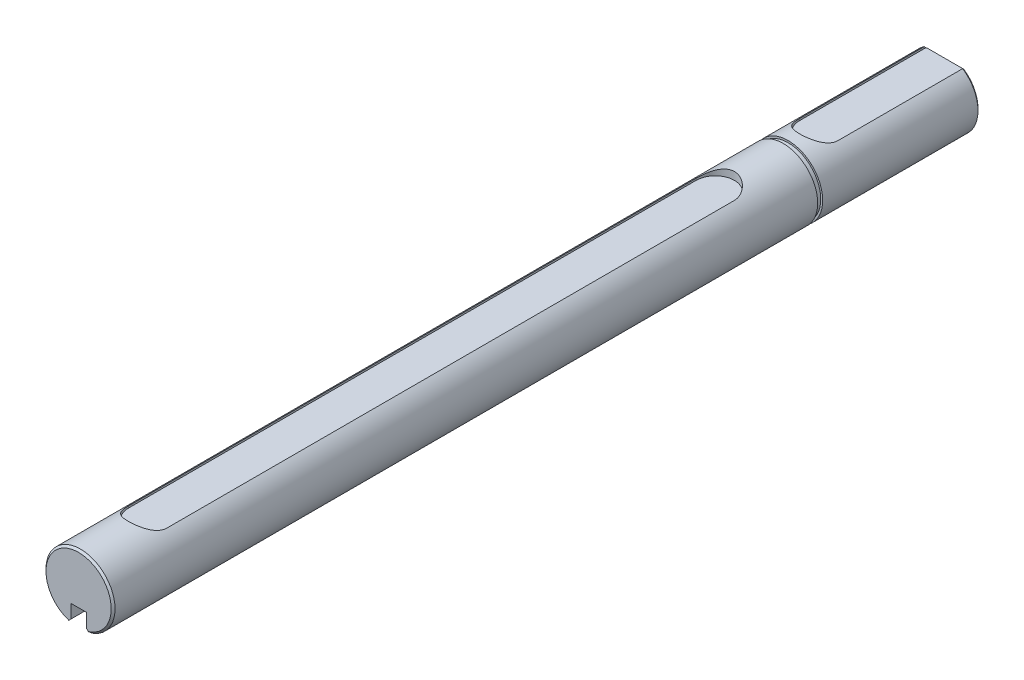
ISO-10303-21;
HEADER;
FILE_DESCRIPTION(('STEP AP214'),'2;1');
FILE_NAME('part.step','',(''),(''),'','','');
FILE_SCHEMA(('AUTOMOTIVE_DESIGN { 1 0 10303 214 1 1 1 1 }'));
ENDSEC;
DATA;
#1=APPLICATION_CONTEXT('core data for automotive mechanical design processes');
#2=APPLICATION_PROTOCOL_DEFINITION('international standard','automotive_design',2000,#1);
#3=PRODUCT_CONTEXT('',#1,'mechanical');
#4=PRODUCT('Part','Part','',(#3));
#5=PRODUCT_RELATED_PRODUCT_CATEGORY('part','',(#4));
#6=PRODUCT_DEFINITION_FORMATION('','',#4);
#7=PRODUCT_DEFINITION_CONTEXT('part definition',#1,'design');
#8=PRODUCT_DEFINITION('design','',#6,#7);
#9=PRODUCT_DEFINITION_SHAPE('','',#8);
#10=(LENGTH_UNIT() NAMED_UNIT(*) SI_UNIT(.MILLI.,.METRE.));
#11=(NAMED_UNIT(*) PLANE_ANGLE_UNIT() SI_UNIT($,.RADIAN.));
#12=(NAMED_UNIT(*) SI_UNIT($,.STERADIAN.) SOLID_ANGLE_UNIT());
#13=UNCERTAINTY_MEASURE_WITH_UNIT(LENGTH_MEASURE(1.E-05),#10,'distance_accuracy_value','');
#14=(GEOMETRIC_REPRESENTATION_CONTEXT(3) GLOBAL_UNCERTAINTY_ASSIGNED_CONTEXT((#13)) GLOBAL_UNIT_ASSIGNED_CONTEXT((#10,
#11,#12)) REPRESENTATION_CONTEXT('',''));
#15=CARTESIAN_POINT('',(0.,0.,0.));
#16=DIRECTION('',(0.,0.,1.));
#17=DIRECTION('',(1.,0.,0.));
#18=AXIS2_PLACEMENT_3D('',#15,#16,#17);
#19=CARTESIAN_POINT('',(0.,7.,-193.));
#20=DIRECTION('',(0.,1.,0.));
#21=DIRECTION('',(-1.,0.,0.));
#22=AXIS2_PLACEMENT_3D('',#19,#20,#21);
#23=CYLINDRICAL_SURFACE('',#22,5.);
#24=DIRECTION('',(0.,-1.,0.));
#25=VECTOR('',#24,1.);
#26=CARTESIAN_POINT('',(5.,8.,-193.));
#27=LINE('',#26,#25);
#28=CARTESIAN_POINT('',(5.00000000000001,7.48331477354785,-193.));
#29=VERTEX_POINT('',#28);
#30=CARTESIAN_POINT('',(5.,7.00000000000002,-193.));
#31=VERTEX_POINT('',#30);
#32=EDGE_CURVE('E143',#29,#31,#27,.T.);
#33=ORIENTED_EDGE('',*,*,#32,.T.);
#34=CARTESIAN_POINT('',(0.,7.,-193.));
#35=DIRECTION('',(0.,1.,0.));
#36=DIRECTION('',(-1.,0.,0.));
#37=AXIS2_PLACEMENT_3D('',#34,#35,#36);
#38=CIRCLE('',#37,5.);
#39=CARTESIAN_POINT('',(-5.,7.00000000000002,-193.));
#40=VERTEX_POINT('',#39);
#41=EDGE_CURVE('E168',#31,#40,#38,.F.);
#42=ORIENTED_EDGE('',*,*,#41,.T.);
#43=DIRECTION('',(0.,1.,0.));
#44=VECTOR('',#43,1.);
#45=CARTESIAN_POINT('',(-5.,8.,-193.));
#46=LINE('',#45,#44);
#47=CARTESIAN_POINT('',(-5.00000000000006,7.48331477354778,-193.));
#48=VERTEX_POINT('',#47);
#49=EDGE_CURVE('E157',#40,#48,#46,.T.);
#50=ORIENTED_EDGE('',*,*,#49,.T.);
#51=CARTESIAN_POINT('',(-5.,7.48331477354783,-193.));
#52=CARTESIAN_POINT('',(-5.00001374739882,7.48329038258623,-192.890749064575));
#53=CARTESIAN_POINT('',(-4.99641969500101,7.48570664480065,-192.781511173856));
#54=CARTESIAN_POINT('',(-4.98212333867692,7.49523721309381,-192.56375303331));
#55=CARTESIAN_POINT('',(-4.97142409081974,7.50234949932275,-192.455232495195));
#56=CARTESIAN_POINT('',(-4.94292336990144,7.52115589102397,-192.238737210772));
#57=CARTESIAN_POINT('',(-4.9250718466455,7.53288227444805,-192.130771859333));
#58=CARTESIAN_POINT('',(-4.88247272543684,7.56056231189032,-191.916775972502));
#59=CARTESIAN_POINT('',(-4.85772448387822,7.57651636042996,-191.810745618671));
#60=CARTESIAN_POINT('',(-4.77283998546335,7.63050267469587,-191.493989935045));
#61=CARTESIAN_POINT('',(-4.70237573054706,7.67444246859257,-191.286935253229));
#62=CARTESIAN_POINT('',(-4.53542945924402,7.77427771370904,-190.883839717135));
#63=CARTESIAN_POINT('',(-4.43864699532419,7.83030958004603,-190.687959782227));
#64=CARTESIAN_POINT('',(-4.22063980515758,7.94995509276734,-190.310364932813));
#65=CARTESIAN_POINT('',(-4.09920488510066,8.01363187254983,-190.128791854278));
#66=CARTESIAN_POINT('',(-3.83383147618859,8.14393398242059,-189.78294608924));
#67=CARTESIAN_POINT('',(-3.68981020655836,8.21056948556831,-189.618740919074));
#68=CARTESIAN_POINT('',(-3.38155656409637,8.34224816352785,-189.310490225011));
#69=CARTESIAN_POINT('',(-3.21736385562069,8.40729417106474,-189.166406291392));
#70=CARTESIAN_POINT('',(-2.87142978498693,8.53161351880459,-188.900965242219));
#71=CARTESIAN_POINT('',(-2.68981521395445,8.5909230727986,-188.779460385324));
#72=CARTESIAN_POINT('',(-2.31205434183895,8.70015280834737,-188.561364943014));
#73=CARTESIAN_POINT('',(-2.1160687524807,8.75015969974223,-188.464540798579));
#74=CARTESIAN_POINT('',(-1.71290388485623,8.83787526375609,-188.297549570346));
#75=CARTESIAN_POINT('',(-1.50586450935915,8.87570811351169,-188.227112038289));
#76=CARTESIAN_POINT('',(-1.0841905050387,8.93697329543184,-188.114129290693));
#77=CARTESIAN_POINT('',(-0.869638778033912,8.96052945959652,-188.071344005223));
#78=CARTESIAN_POINT('',(-0.436708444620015,8.99200401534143,-188.01435026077));
#79=CARTESIAN_POINT('',(-0.218354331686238,8.99999999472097,-188.000000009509));
#80=CARTESIAN_POINT('',(0.21835389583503,9.00000000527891,-187.999999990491));
#81=CARTESIAN_POINT('',(0.43670801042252,8.99200403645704,-188.014350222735));
#82=CARTESIAN_POINT('',(0.869638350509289,8.96052950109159,-188.071343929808));
#83=CARTESIAN_POINT('',(1.0841900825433,8.93697334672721,-188.11412919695));
#84=CARTESIAN_POINT('',(1.50586410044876,8.87570818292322,-188.227111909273));
#85=CARTESIAN_POINT('',(1.71290348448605,8.83787534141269,-188.297549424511));
#86=CARTESIAN_POINT('',(2.11606837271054,8.75015979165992,-188.464540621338));
#87=CARTESIAN_POINT('',(2.3120539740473,8.70015290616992,-188.561364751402));
#88=CARTESIAN_POINT('',(2.68981487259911,8.5909231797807,-188.779460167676));
#89=CARTESIAN_POINT('',(2.87142945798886,8.53161362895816,-188.900965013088));
#90=CARTESIAN_POINT('',(3.21736354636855,8.40729428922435,-189.166406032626));
#91=CARTESIAN_POINT('',(3.38155625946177,8.34224828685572,-189.310489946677));
#92=CARTESIAN_POINT('',(3.6898099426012,8.21056960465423,-189.618740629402));
#93=CARTESIAN_POINT('',(3.83383124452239,8.14393409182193,-189.782945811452));
#94=CARTESIAN_POINT('',(4.09920471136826,8.01363196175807,-190.128791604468));
#95=CARTESIAN_POINT('',(4.22063965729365,7.94995517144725,-190.310364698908));
#96=CARTESIAN_POINT('',(4.4386468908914,7.83030963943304,-190.687959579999));
#97=CARTESIAN_POINT('',(4.53542937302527,7.77427776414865,-190.883839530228));
#98=CARTESIAN_POINT('',(4.70237568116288,7.67444249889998,-191.286935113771));
#99=CARTESIAN_POINT('',(4.77283995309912,7.63050269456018,-191.49398982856));
#100=CARTESIAN_POINT('',(4.8577244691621,7.57651636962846,-191.810745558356));
#101=CARTESIAN_POINT('',(4.88247271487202,7.5605623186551,-191.916775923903));
#102=CARTESIAN_POINT('',(4.92507184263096,7.53288227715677,-192.130771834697));
#103=CARTESIAN_POINT('',(4.94292336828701,7.52115589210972,-192.238737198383));
#104=CARTESIAN_POINT('',(4.9714240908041,7.50234949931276,-192.455232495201));
#105=CARTESIAN_POINT('',(4.98212333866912,7.49523721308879,-192.563753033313));
#106=CARTESIAN_POINT('',(4.99641969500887,7.48570664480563,-192.781511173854));
#107=CARTESIAN_POINT('',(5.00001374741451,7.4832903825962,-192.890749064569));
#108=CARTESIAN_POINT('',(5.,7.48331477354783,-193.));
#109=B_SPLINE_CURVE_WITH_KNOTS('',3,(#51,#52,#53,#54,#55,#56,#57,#58,#59,#60,#61,#62,#63,#64,
#65,#66,#67,#68,#69,#70,#71,#72,#73,#74,#75,#76,#77,#78,#79,#80,#81,#82,#83,#84,#85,#86,#87,#88,
#89,#90,#91,#92,#93,#94,#95,#96,#97,#98,#99,#100,#101,#102,#103,#104,#105,#106,#107,#108),
.UNSPECIFIED.,.F.,.F.,(4,2,2,2,2,2,2,2,2,2,2,2,2,2,2,2,2,2,2,2,2,2,2,2,2,2,2,2,4),(0.,
0.327645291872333,0.655149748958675,0.984987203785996,1.31485544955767,1.98161894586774,
2.65633924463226,3.33707417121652,4.02036500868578,4.70233313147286,5.37966842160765,
6.05033369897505,6.7139236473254,7.37167220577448,8.02613254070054,8.68059287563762,
9.33834143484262,10.0019313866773,10.6725966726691,11.3499319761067,12.031900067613,
12.715190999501,13.3959260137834,14.0706463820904,14.7374099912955,15.0672782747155,
15.3971157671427,15.7246202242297,16.0522655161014),.UNSPECIFIED.);
#110=EDGE_CURVE('E21',#48,#29,#109,.T.);
#111=ORIENTED_EDGE('',*,*,#110,.T.);
#112=EDGE_LOOP('',(#33,#42,#50,#111));
#113=FACE_BOUND('',#112,.T.);
#114=ADVANCED_FACE('F17',(#113),#23,.F.);
#115=CARTESIAN_POINT('',(-5.,7.,-188.));
#116=DIRECTION('',(0.,-1.,0.));
#117=DIRECTION('',(0.,0.,-1.));
#118=AXIS2_PLACEMENT_3D('',#115,#116,#117);
#119=PLANE('',#118);
#120=CARTESIAN_POINT('',(4.82182538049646,7.,-226.));
#121=CARTESIAN_POINT('',(4.85161069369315,7.,-225.983101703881));
#122=CARTESIAN_POINT('',(4.88135123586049,7.,-225.96612544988));
#123=CARTESIAN_POINT('',(4.94074277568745,7.,-225.93201702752));
#124=CARTESIAN_POINT('',(4.97039377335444,7.,-225.914884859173));
#125=CARTESIAN_POINT('',(4.99999999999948,7.,-225.897674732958));
#126=B_SPLINE_CURVE_WITH_KNOTS('',3,(#120,#121,#122,#123,#124,#125),.UNSPECIFIED.,.F.,.F.,(4,2,
4),(0.,0.102733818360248,0.205467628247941),.UNSPECIFIED.);
#127=CARTESIAN_POINT('',(4.8218253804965,6.99999999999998,-226.));
#128=VERTEX_POINT('',#127);
#129=CARTESIAN_POINT('',(4.99999999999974,7.00000000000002,-225.897674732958));
#130=VERTEX_POINT('',#129);
#131=EDGE_CURVE('E428',#128,#130,#126,.T.);
#132=ORIENTED_EDGE('',*,*,#131,.F.);
#133=DIRECTION('',(1.,0.,0.));
#134=VECTOR('',#133,1.);
#135=CARTESIAN_POINT('',(-3.9537630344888,6.99999999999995,-226.));
#136=LINE('',#135,#134);
#137=CARTESIAN_POINT('',(-4.82182538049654,6.99999999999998,-226.));
#138=VERTEX_POINT('',#137);
#139=EDGE_CURVE('E342',#138,#128,#136,.T.);
#140=ORIENTED_EDGE('',*,*,#139,.F.);
#141=CARTESIAN_POINT('',(-4.82182538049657,7.,-226.));
#142=CARTESIAN_POINT('',(-4.85161069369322,7.,-225.983101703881));
#143=CARTESIAN_POINT('',(-4.88135123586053,7.,-225.96612544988));
#144=CARTESIAN_POINT('',(-4.94074277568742,7.,-225.93201702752));
#145=CARTESIAN_POINT('',(-4.97039377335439,7.,-225.914884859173));
#146=CARTESIAN_POINT('',(-4.99999999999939,7.,-225.897674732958));
#147=B_SPLINE_CURVE_WITH_KNOTS('',3,(#141,#142,#143,#144,#145,#146),.UNSPECIFIED.,.F.,.F.,(4,2,
4),(0.,0.102733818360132,0.205467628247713),.UNSPECIFIED.);
#148=CARTESIAN_POINT('',(-4.9999999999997,6.99999999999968,-225.897674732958));
#149=VERTEX_POINT('',#148);
#150=EDGE_CURVE('E338',#138,#149,#147,.T.);
#151=ORIENTED_EDGE('',*,*,#150,.T.);
#152=DIRECTION('',(0.,0.,1.));
#153=VECTOR('',#152,1.);
#154=CARTESIAN_POINT('',(-5.,7.00000000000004,-209.44883736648));
#155=LINE('',#154,#153);
#156=EDGE_CURVE('E333',#149,#40,#155,.T.);
#157=ORIENTED_EDGE('',*,*,#156,.T.);
#158=ORIENTED_EDGE('',*,*,#41,.F.);
#159=DIRECTION('',(0.,0.,-1.));
#160=VECTOR('',#159,1.);
#161=CARTESIAN_POINT('',(5.,7.00000000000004,-209.44883736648));
#162=LINE('',#161,#160);
#163=EDGE_CURVE('E329',#31,#130,#162,.T.);
#164=ORIENTED_EDGE('',*,*,#163,.T.);
#165=EDGE_LOOP('',(#132,#140,#151,#157,#158,#164));
#166=FACE_BOUND('',#165,.T.);
#167=ADVANCED_FACE('F211',(#166),#119,.F.);
#168=CARTESIAN_POINT('',(8.5,-14.0683508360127,-226.));
#169=DIRECTION('',(0.,0.,-1.));
#170=DIRECTION('',(-1.,0.,0.));
#171=AXIS2_PLACEMENT_3D('',#168,#169,#170);
#172=PLANE('',#171);
#173=ORIENTED_EDGE('',*,*,#139,.T.);
#174=CARTESIAN_POINT('',(0.,0.,-226.));
#175=DIRECTION('',(0.,0.,1.));
#176=DIRECTION('',(1.,0.,0.));
#177=AXIS2_PLACEMENT_3D('',#174,#175,#176);
#178=CIRCLE('',#177,8.5);
#179=EDGE_CURVE('E165',#128,#138,#178,.F.);
#180=ORIENTED_EDGE('',*,*,#179,.T.);
#181=EDGE_LOOP('',(#173,#180));
#182=FACE_BOUND('',#181,.T.);
#183=ADVANCED_FACE('F364',(#182),#172,.T.);
#184=CARTESIAN_POINT('',(-5.,7.4833147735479,-225.89767473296));
#185=DIRECTION('',(-1.,0.,0.));
#186=DIRECTION('',(0.,-1.,0.));
#187=AXIS2_PLACEMENT_3D('',#184,#185,#186);
#188=PLANE('',#187);
#189=CARTESIAN_POINT('',(-5.00000000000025,7.48331477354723,-225.500000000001));
#190=CARTESIAN_POINT('',(-4.99999999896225,7.41653903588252,-225.555522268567));
#191=CARTESIAN_POINT('',(-4.99999999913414,7.34965097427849,-225.610909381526));
#192=CARTESIAN_POINT('',(-4.99999999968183,7.26023887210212,-225.684620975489));
#193=CARTESIAN_POINT('',(-4.99999999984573,7.2378213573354,-225.703074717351));
#194=CARTESIAN_POINT('',(-5.00000000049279,7.14373623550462,-225.780406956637));
#195=CARTESIAN_POINT('',(-5.00000000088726,7.07194260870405,-225.839132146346));
#196=CARTESIAN_POINT('',(-5.,6.99999999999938,-225.897674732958));
#197=B_SPLINE_CURVE_WITH_KNOTS('',3,(#189,#190,#191,#192,#193,#194,#195,#196),.UNSPECIFIED.,.F.,
.F.,(4,2,2,4),(0.,0.2605289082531,0.34763668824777,0.625892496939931),.UNSPECIFIED.);
#198=CARTESIAN_POINT('',(-5.,7.48331477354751,-225.5));
#199=VERTEX_POINT('',#198);
#200=EDGE_CURVE('E163',#199,#149,#197,.T.);
#201=ORIENTED_EDGE('',*,*,#200,.F.);
#202=DIRECTION('',(0.,0.,1.));
#203=VECTOR('',#202,1.);
#204=CARTESIAN_POINT('',(-5.00000000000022,7.48331477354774,-113.));
#205=LINE('',#204,#203);
#206=EDGE_CURVE('E153',#199,#48,#205,.T.);
#207=ORIENTED_EDGE('',*,*,#206,.T.);
#208=ORIENTED_EDGE('',*,*,#49,.F.);
#209=ORIENTED_EDGE('',*,*,#156,.F.);
#210=EDGE_LOOP('',(#201,#207,#208,#209));
#211=FACE_BOUND('',#210,.T.);
#212=ADVANCED_FACE('F159',(#211),#188,.F.);
#213=CARTESIAN_POINT('',(5.,7.4833147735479,-193.));
#214=DIRECTION('',(1.,0.,0.));
#215=DIRECTION('',(0.,-1.,0.));
#216=AXIS2_PLACEMENT_3D('',#213,#214,#215);
#217=PLANE('',#216);
#218=DIRECTION('',(0.,0.,-1.));
#219=VECTOR('',#218,1.);
#220=CARTESIAN_POINT('',(5.00000000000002,7.48331477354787,-113.));
#221=LINE('',#220,#219);
#222=CARTESIAN_POINT('',(5.00000000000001,7.48331477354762,-225.5));
#223=VERTEX_POINT('',#222);
#224=EDGE_CURVE('E154',#29,#223,#221,.T.);
#225=ORIENTED_EDGE('',*,*,#224,.T.);
#226=CARTESIAN_POINT('',(5.,7.48331477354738,-225.5));
#227=CARTESIAN_POINT('',(5.,7.41185962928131,-225.559413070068));
#228=CARTESIAN_POINT('',(5.,7.34027590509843,-225.618671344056));
#229=CARTESIAN_POINT('',(5.,7.25614206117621,-225.687988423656));
#230=CARTESIAN_POINT('',(5.,7.24372574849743,-225.69820968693));
#231=CARTESIAN_POINT('',(5.,7.15436772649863,-225.771709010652));
#232=CARTESIAN_POINT('',(5.,7.07726981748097,-225.834797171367));
#233=CARTESIAN_POINT('',(5.,6.99999999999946,-225.897674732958));
#234=B_SPLINE_CURVE_WITH_KNOTS('',3,(#226,#227,#228,#229,#230,#231,#232,#233),.UNSPECIFIED.,.F.,
.F.,(4,2,2,4),(0.,0.278785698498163,0.327032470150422,0.625892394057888),.UNSPECIFIED.);
#235=EDGE_CURVE('E332',#223,#130,#234,.T.);
#236=ORIENTED_EDGE('',*,*,#235,.T.);
#237=ORIENTED_EDGE('',*,*,#163,.F.);
#238=ORIENTED_EDGE('',*,*,#32,.F.);
#239=EDGE_LOOP('',(#225,#236,#237,#238));
#240=FACE_BOUND('',#239,.T.);
#241=ADVANCED_FACE('F363',(#240),#217,.F.);
#242=CARTESIAN_POINT('',(0.,0.,-226.));
#243=DIRECTION('',(0.,0.,1.));
#244=DIRECTION('',(1.,0.,0.));
#245=AXIS2_PLACEMENT_3D('',#242,#243,#244);
#246=CONICAL_SURFACE('',#245,8.5,0.785398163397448);
#247=ORIENTED_EDGE('',*,*,#179,.F.);
#248=ORIENTED_EDGE('',*,*,#131,.T.);
#249=ORIENTED_EDGE('',*,*,#235,.F.);
#250=CARTESIAN_POINT('',(0.,0.,-225.5));
#251=DIRECTION('',(0.,0.,1.));
#252=DIRECTION('',(1.,0.,0.));
#253=AXIS2_PLACEMENT_3D('',#250,#251,#252);
#254=CIRCLE('',#253,9.);
#255=EDGE_CURVE('E335',#223,#199,#254,.F.);
#256=ORIENTED_EDGE('',*,*,#255,.T.);
#257=ORIENTED_EDGE('',*,*,#200,.T.);
#258=ORIENTED_EDGE('',*,*,#150,.F.);
#259=EDGE_LOOP('',(#247,#248,#249,#256,#257,#258));
#260=FACE_BOUND('',#259,.T.);
#261=ADVANCED_FACE('F359',(#260),#246,.T.);
#262=CARTESIAN_POINT('',(0.,0.,-225.5));
#263=DIRECTION('',(0.,0.,1.));
#264=DIRECTION('',(0.,-1.,0.));
#265=AXIS2_PLACEMENT_3D('',#262,#263,#264);
#266=CYLINDRICAL_SURFACE('',#265,9.);
#267=ORIENTED_EDGE('',*,*,#206,.F.);
#268=ORIENTED_EDGE('',*,*,#255,.F.);
#269=ORIENTED_EDGE('',*,*,#224,.F.);
#270=ORIENTED_EDGE('',*,*,#110,.F.);
#271=EDGE_LOOP('',(#267,#268,#269,#270));
#272=FACE_BOUND('',#271,.T.);
#273=CARTESIAN_POINT('',(0.,0.,-185.));
#274=DIRECTION('',(0.,0.,1.));
#275=DIRECTION('',(0.,-1.,0.));
#276=AXIS2_PLACEMENT_3D('',#273,#274,#275);
#277=CIRCLE('',#276,9.);
#278=CARTESIAN_POINT('',(0.,-9.00000000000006,-185.));
#279=VERTEX_POINT('',#278);
#280=EDGE_CURVE('E323',#279,#279,#277,.F.);
#281=ORIENTED_EDGE('',*,*,#280,.T.);
#282=EDGE_LOOP('',(#281));
#283=FACE_BOUND('',#282,.T.);
#284=ADVANCED_FACE('F150',(#272,#283),#266,.T.);
#285=CARTESIAN_POINT('',(-17.5595086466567,-2.78115294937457,-185.));
#286=DIRECTION('',(0.,0.,-1.));
#287=DIRECTION('',(0.587785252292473,0.809016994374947,0.));
#288=AXIS2_PLACEMENT_3D('',#285,#286,#287);
#289=PLANE('',#288);
#290=CARTESIAN_POINT('',(0.,0.,-185.));
#291=DIRECTION('',(0.,0.,1.));
#292=DIRECTION('',(1.,0.,0.));
#293=AXIS2_PLACEMENT_3D('',#290,#291,#292);
#294=CIRCLE('',#293,8.50000000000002);
#295=CARTESIAN_POINT('',(8.50000000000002,0.,-185.));
#296=VERTEX_POINT('',#295);
#297=EDGE_CURVE('E312',#296,#296,#294,.F.);
#298=ORIENTED_EDGE('',*,*,#297,.T.);
#299=EDGE_LOOP('',(#298));
#300=FACE_BOUND('',#299,.T.);
#301=ORIENTED_EDGE('',*,*,#280,.F.);
#302=EDGE_LOOP('',(#301));
#303=FACE_BOUND('',#302,.T.);
#304=ADVANCED_FACE('F368',(#300,#303),#289,.F.);
#305=CARTESIAN_POINT('',(0.,7.,-18.));
#306=DIRECTION('',(0.,1.,0.));
#307=DIRECTION('',(-1.,0.,0.));
#308=AXIS2_PLACEMENT_3D('',#305,#306,#307);
#309=CYLINDRICAL_SURFACE('',#308,5.);
#310=DIRECTION('',(0.,-1.,0.));
#311=VECTOR('',#310,1.);
#312=CARTESIAN_POINT('',(5.,8.,-18.0000000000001));
#313=LINE('',#312,#311);
#314=CARTESIAN_POINT('',(5.00000000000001,7.48331477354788,-18.));
#315=VERTEX_POINT('',#314);
#316=CARTESIAN_POINT('',(5.,7.00000000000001,-18.));
#317=VERTEX_POINT('',#316);
#318=EDGE_CURVE('E317',#315,#317,#313,.T.);
#319=ORIENTED_EDGE('',*,*,#318,.T.);
#320=CARTESIAN_POINT('',(0.,7.,-18.));
#321=DIRECTION('',(0.,1.,0.));
#322=DIRECTION('',(-1.,0.,0.));
#323=AXIS2_PLACEMENT_3D('',#320,#321,#322);
#324=CIRCLE('',#323,5.);
#325=CARTESIAN_POINT('',(-5.,7.00000000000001,-18.));
#326=VERTEX_POINT('',#325);
#327=EDGE_CURVE('E493',#317,#326,#324,.F.);
#328=ORIENTED_EDGE('',*,*,#327,.T.);
#329=DIRECTION('',(0.,1.,0.));
#330=VECTOR('',#329,1.);
#331=CARTESIAN_POINT('',(-5.,8.,-18.));
#332=LINE('',#331,#330);
#333=CARTESIAN_POINT('',(-5.00000000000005,7.48331477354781,-18.));
#334=VERTEX_POINT('',#333);
#335=EDGE_CURVE('E320',#326,#334,#332,.T.);
#336=ORIENTED_EDGE('',*,*,#335,.T.);
#337=CARTESIAN_POINT('',(-5.00000000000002,7.4833147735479,-18.0000000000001));
#338=CARTESIAN_POINT('',(-5.00001374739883,7.48329038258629,-17.8907490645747));
#339=CARTESIAN_POINT('',(-4.996419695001,7.48570664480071,-17.7815111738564));
#340=CARTESIAN_POINT('',(-4.9821233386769,7.49523721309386,-17.5637530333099));
#341=CARTESIAN_POINT('',(-4.97142409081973,7.5023494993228,-17.4552324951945));
#342=CARTESIAN_POINT('',(-4.94292336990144,7.52115589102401,-17.2387372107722));
#343=CARTESIAN_POINT('',(-4.92507184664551,7.53288227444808,-17.1307718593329));
#344=CARTESIAN_POINT('',(-4.8824727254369,7.56056231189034,-16.9167759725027));
#345=CARTESIAN_POINT('',(-4.85772448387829,7.57651636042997,-16.8107456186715));
#346=CARTESIAN_POINT('',(-4.77283998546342,7.63050267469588,-16.4939899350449));
#347=CARTESIAN_POINT('',(-4.70237573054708,7.67444246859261,-16.2869352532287));
#348=CARTESIAN_POINT('',(-4.53542945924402,7.77427771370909,-15.8838397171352));
#349=CARTESIAN_POINT('',(-4.43864699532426,7.83030958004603,-15.6879597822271));
#350=CARTESIAN_POINT('',(-4.22063980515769,7.94995509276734,-15.3103649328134));
#351=CARTESIAN_POINT('',(-4.0992048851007,8.01363187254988,-15.1287918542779));
#352=CARTESIAN_POINT('',(-3.83383147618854,8.14393398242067,-14.78294608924));
#353=CARTESIAN_POINT('',(-3.6898102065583,8.21056948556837,-14.6187409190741));
#354=CARTESIAN_POINT('',(-3.38155656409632,8.3422481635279,-14.3104902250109));
#355=CARTESIAN_POINT('',(-3.21736385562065,8.4072941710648,-14.1664062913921));
#356=CARTESIAN_POINT('',(-2.87142978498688,8.53161351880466,-13.9009652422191));
#357=CARTESIAN_POINT('',(-2.68981521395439,8.59092307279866,-13.7794603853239));
#358=CARTESIAN_POINT('',(-2.31205434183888,8.70015280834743,-13.561364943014));
#359=CARTESIAN_POINT('',(-2.11606875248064,8.75015969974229,-13.4645407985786));
#360=CARTESIAN_POINT('',(-1.71290388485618,8.83787526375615,-13.2975495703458));
#361=CARTESIAN_POINT('',(-1.5058645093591,8.87570811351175,-13.2271120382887));
#362=CARTESIAN_POINT('',(-1.08419050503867,8.93697329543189,-13.1141292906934));
#363=CARTESIAN_POINT('',(-0.869638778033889,8.96052945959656,-13.0713440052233));
#364=CARTESIAN_POINT('',(-0.436708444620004,8.99200401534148,-13.0143502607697));
#365=CARTESIAN_POINT('',(-0.218354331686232,8.99999999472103,-13.0000000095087));
#366=CARTESIAN_POINT('',(0.218353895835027,9.00000000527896,-12.9999999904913));
#367=CARTESIAN_POINT('',(0.436708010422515,8.99200403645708,-13.0143502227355));
#368=CARTESIAN_POINT('',(0.869638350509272,8.96052950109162,-13.0713439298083));
#369=CARTESIAN_POINT('',(1.08419008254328,8.93697334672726,-13.1141291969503));
#370=CARTESIAN_POINT('',(1.50586410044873,8.87570818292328,-13.2271119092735));
#371=CARTESIAN_POINT('',(1.71290348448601,8.83787534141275,-13.2975494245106));
#372=CARTESIAN_POINT('',(2.11606837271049,8.75015979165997,-13.4645406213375));
#373=CARTESIAN_POINT('',(2.31205397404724,8.70015290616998,-13.5613647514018));
#374=CARTESIAN_POINT('',(2.68981487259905,8.59092317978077,-13.7794601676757));
#375=CARTESIAN_POINT('',(2.87142945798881,8.53161362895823,-13.9009650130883));
#376=CARTESIAN_POINT('',(3.2173635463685,8.40729428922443,-14.1664060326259));
#377=CARTESIAN_POINT('',(3.38155625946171,8.3422482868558,-14.3104899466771));
#378=CARTESIAN_POINT('',(3.68980994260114,8.2105696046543,-14.6187406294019));
#379=CARTESIAN_POINT('',(3.83383124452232,8.14393409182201,-14.7829458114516));
#380=CARTESIAN_POINT('',(4.09920471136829,8.0136319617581,-15.128791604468));
#381=CARTESIAN_POINT('',(4.22063965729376,7.94995517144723,-15.3103646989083));
#382=CARTESIAN_POINT('',(4.43864689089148,7.83030963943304,-15.6879595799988));
#383=CARTESIAN_POINT('',(4.53542937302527,7.7742777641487,-15.8838395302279));
#384=CARTESIAN_POINT('',(4.70237568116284,7.67444249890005,-16.286935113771));
#385=CARTESIAN_POINT('',(4.7728399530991,7.63050269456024,-16.4939898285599));
#386=CARTESIAN_POINT('',(4.85772446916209,7.57651636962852,-16.8107455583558));
#387=CARTESIAN_POINT('',(4.88247271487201,7.56056231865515,-16.9167759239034));
#388=CARTESIAN_POINT('',(4.92507184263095,7.53288227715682,-17.1307718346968));
#389=CARTESIAN_POINT('',(4.942923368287,7.52115589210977,-17.2387371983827));
#390=CARTESIAN_POINT('',(4.97142409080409,7.50234949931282,-17.4552324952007));
#391=CARTESIAN_POINT('',(4.98212333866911,7.49523721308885,-17.5637530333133));
#392=CARTESIAN_POINT('',(4.99641969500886,7.48570664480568,-17.7815111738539));
#393=CARTESIAN_POINT('',(5.00001374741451,7.48329038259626,-17.890749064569));
#394=CARTESIAN_POINT('',(5.,7.48331477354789,-18.0000000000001));
#395=B_SPLINE_CURVE_WITH_KNOTS('',3,(#337,#338,#339,#340,#341,#342,#343,#344,#345,#346,#347,
#348,#349,#350,#351,#352,#353,#354,#355,#356,#357,#358,#359,#360,#361,#362,#363,#364,#365,#366,
#367,#368,#369,#370,#371,#372,#373,#374,#375,#376,#377,#378,#379,#380,#381,#382,#383,#384,#385,
#386,#387,#388,#389,#390,#391,#392,#393,#394),.UNSPECIFIED.,.F.,.F.,(4,2,2,2,2,2,2,2,2,2,2,2,2,
2,2,2,2,2,2,2,2,2,2,2,2,2,2,2,4),(0.,0.327645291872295,0.655149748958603,0.984987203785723,
1.31485544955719,1.98161894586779,2.6563392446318,3.33707417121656,4.02036500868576,
4.70233313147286,5.37966842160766,6.05033369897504,6.71392364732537,7.37167220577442,
8.02613254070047,8.68059287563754,9.33834143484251,10.0019313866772,10.6725966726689,
11.3499319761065,12.0319000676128,12.7151909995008,13.3959260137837,14.0706463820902,
14.7374099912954,15.0672782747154,15.3971157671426,15.7246202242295,16.0522655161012),.UNSPECIFIED.);
#396=EDGE_CURVE('E319',#334,#315,#395,.T.);
#397=ORIENTED_EDGE('',*,*,#396,.T.);
#398=EDGE_LOOP('',(#319,#328,#336,#397));
#399=FACE_BOUND('',#398,.T.);
#400=ADVANCED_FACE('F371',(#399),#309,.F.);
#401=CARTESIAN_POINT('',(0.,7.,-166.));
#402=DIRECTION('',(0.,1.,0.));
#403=DIRECTION('',(-1.,0.,0.));
#404=AXIS2_PLACEMENT_3D('',#401,#402,#403);
#405=CYLINDRICAL_SURFACE('',#404,5.);
#406=DIRECTION('',(0.,-1.,0.));
#407=VECTOR('',#406,1.);
#408=CARTESIAN_POINT('',(-5.,8.,-166.));
#409=LINE('',#408,#407);
#410=CARTESIAN_POINT('',(-5.00000000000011,7.48331477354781,-166.));
#411=VERTEX_POINT('',#410);
#412=CARTESIAN_POINT('',(-5.,7.00000000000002,-166.));
#413=VERTEX_POINT('',#412);
#414=EDGE_CURVE('E310',#411,#413,#409,.T.);
#415=ORIENTED_EDGE('',*,*,#414,.T.);
#416=CARTESIAN_POINT('',(0.,7.,-166.));
#417=DIRECTION('',(0.,1.,0.));
#418=DIRECTION('',(-1.,0.,0.));
#419=AXIS2_PLACEMENT_3D('',#416,#417,#418);
#420=CIRCLE('',#419,5.);
#421=CARTESIAN_POINT('',(5.,7.00000000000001,-166.));
#422=VERTEX_POINT('',#421);
#423=EDGE_CURVE('E491',#413,#422,#420,.F.);
#424=ORIENTED_EDGE('',*,*,#423,.T.);
#425=DIRECTION('',(0.,1.,0.));
#426=VECTOR('',#425,1.);
#427=CARTESIAN_POINT('',(5.,8.,-166.));
#428=LINE('',#427,#426);
#429=CARTESIAN_POINT('',(5.00000000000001,7.48331477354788,-166.));
#430=VERTEX_POINT('',#429);
#431=EDGE_CURVE('E314',#422,#430,#428,.T.);
#432=ORIENTED_EDGE('',*,*,#431,.T.);
#433=CARTESIAN_POINT('',(5.,7.48331477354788,-166.));
#434=CARTESIAN_POINT('',(5.00001374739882,7.48329038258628,-166.109250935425));
#435=CARTESIAN_POINT('',(4.996419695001,7.48570664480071,-166.218488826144));
#436=CARTESIAN_POINT('',(4.98212333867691,7.49523721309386,-166.43624696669));
#437=CARTESIAN_POINT('',(4.97142409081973,7.5023494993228,-166.544767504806));
#438=CARTESIAN_POINT('',(4.94292336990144,7.52115589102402,-166.761262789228));
#439=CARTESIAN_POINT('',(4.9250718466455,7.53288227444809,-166.869228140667));
#440=CARTESIAN_POINT('',(4.88247272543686,7.56056231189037,-167.083224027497));
#441=CARTESIAN_POINT('',(4.85772448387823,7.57651636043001,-167.189254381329));
#442=CARTESIAN_POINT('',(4.77283998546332,7.63050267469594,-167.506010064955));
#443=CARTESIAN_POINT('',(4.70237573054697,7.67444246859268,-167.713064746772));
#444=CARTESIAN_POINT('',(4.53542945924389,7.77427771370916,-168.116160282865));
#445=CARTESIAN_POINT('',(4.43864699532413,7.83030958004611,-168.312040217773));
#446=CARTESIAN_POINT('',(4.22063980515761,7.94995509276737,-168.689635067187));
#447=CARTESIAN_POINT('',(4.09920488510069,8.01363187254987,-168.871208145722));
#448=CARTESIAN_POINT('',(3.83383147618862,8.14393398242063,-169.21705391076));
#449=CARTESIAN_POINT('',(3.68981020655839,8.21056948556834,-169.381259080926));
#450=CARTESIAN_POINT('',(3.3815565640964,8.34224816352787,-169.689509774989));
#451=CARTESIAN_POINT('',(3.21736385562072,8.40729417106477,-169.833593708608));
#452=CARTESIAN_POINT('',(2.87142978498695,8.53161351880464,-170.099034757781));
#453=CARTESIAN_POINT('',(2.68981521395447,8.59092307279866,-170.220539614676));
#454=CARTESIAN_POINT('',(2.31205434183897,8.70015280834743,-170.438635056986));
#455=CARTESIAN_POINT('',(2.11606875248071,8.75015969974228,-170.535459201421));
#456=CARTESIAN_POINT('',(1.71290388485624,8.83787526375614,-170.702450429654));
#457=CARTESIAN_POINT('',(1.50586450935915,8.87570811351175,-170.772887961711));
#458=CARTESIAN_POINT('',(1.0841905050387,8.9369732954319,-170.885870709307));
#459=CARTESIAN_POINT('',(0.869638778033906,8.96052945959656,-170.928655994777));
#460=CARTESIAN_POINT('',(0.43670844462,8.99200401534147,-170.98564973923));
#461=CARTESIAN_POINT('',(0.218354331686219,8.99999999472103,-170.999999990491));
#462=CARTESIAN_POINT('',(-0.218353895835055,9.00000000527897,-171.000000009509));
#463=CARTESIAN_POINT('',(-0.436708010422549,8.99200403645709,-170.985649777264));
#464=CARTESIAN_POINT('',(-0.869638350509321,8.96052950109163,-170.928656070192));
#465=CARTESIAN_POINT('',(-1.08419008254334,8.93697334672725,-170.88587080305));
#466=CARTESIAN_POINT('',(-1.5058641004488,8.87570818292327,-170.772888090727));
#467=CARTESIAN_POINT('',(-1.71290348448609,8.83787534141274,-170.702450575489));
#468=CARTESIAN_POINT('',(-2.11606837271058,8.75015979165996,-170.535459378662));
#469=CARTESIAN_POINT('',(-2.31205397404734,8.70015290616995,-170.438635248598));
#470=CARTESIAN_POINT('',(-2.68981487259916,8.59092317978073,-170.220539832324));
#471=CARTESIAN_POINT('',(-2.87142945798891,8.53161362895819,-170.099034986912));
#472=CARTESIAN_POINT('',(-3.2173635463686,8.40729428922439,-169.833593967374));
#473=CARTESIAN_POINT('',(-3.38155625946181,8.34224828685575,-169.689510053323));
#474=CARTESIAN_POINT('',(-3.68980994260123,8.21056960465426,-169.381259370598));
#475=CARTESIAN_POINT('',(-3.83383124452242,8.14393409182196,-169.217054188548));
#476=CARTESIAN_POINT('',(-4.09920471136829,8.0136319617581,-168.871208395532));
#477=CARTESIAN_POINT('',(-4.22063965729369,7.94995517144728,-168.689635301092));
#478=CARTESIAN_POINT('',(-4.43864689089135,7.83030963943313,-168.312040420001));
#479=CARTESIAN_POINT('',(-4.53542937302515,7.77427776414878,-168.116160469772));
#480=CARTESIAN_POINT('',(-4.70237568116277,7.6744424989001,-167.713064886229));
#481=CARTESIAN_POINT('',(-4.77283995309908,7.63050269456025,-167.50601017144));
#482=CARTESIAN_POINT('',(-4.8577244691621,7.57651636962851,-167.189254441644));
#483=CARTESIAN_POINT('',(-4.88247271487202,7.56056231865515,-167.083224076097));
#484=CARTESIAN_POINT('',(-4.92507184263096,7.53288227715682,-166.869228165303));
#485=CARTESIAN_POINT('',(-4.942923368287,7.52115589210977,-166.761262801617));
#486=CARTESIAN_POINT('',(-4.97142409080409,7.50234949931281,-166.544767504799));
#487=CARTESIAN_POINT('',(-4.98212333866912,7.49523721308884,-166.436246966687));
#488=CARTESIAN_POINT('',(-4.99641969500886,7.48570664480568,-166.218488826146));
#489=CARTESIAN_POINT('',(-5.00001374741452,7.48329038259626,-166.109250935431));
#490=CARTESIAN_POINT('',(-5.,7.48331477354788,-166.));
#491=B_SPLINE_CURVE_WITH_KNOTS('',3,(#433,#434,#435,#436,#437,#438,#439,#440,#441,#442,#443,
#444,#445,#446,#447,#448,#449,#450,#451,#452,#453,#454,#455,#456,#457,#458,#459,#460,#461,#462,
#463,#464,#465,#466,#467,#468,#469,#470,#471,#472,#473,#474,#475,#476,#477,#478,#479,#480,#481,
#482,#483,#484,#485,#486,#487,#488,#489,#490),.UNSPECIFIED.,.F.,.F.,(4,2,2,2,2,2,2,2,2,2,2,2,2,
2,2,2,2,2,2,2,2,2,2,2,2,2,2,2,4),(0.,0.32764529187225,0.655149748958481,0.984987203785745,
1.31485544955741,1.98161894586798,2.65633924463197,3.33707417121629,4.02036500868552,
4.70233313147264,5.37966842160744,6.05033369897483,6.71392364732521,7.37167220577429,
8.02613254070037,8.68059287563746,9.33834143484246,10.0019313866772,10.6725966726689,
11.3499319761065,12.0319000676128,12.7151909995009,13.3959260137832,14.0706463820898,
14.7374099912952,15.0672782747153,15.3971157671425,15.7246202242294,16.0522655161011),.UNSPECIFIED.);
#492=EDGE_CURVE('E313',#430,#411,#491,.T.);
#493=ORIENTED_EDGE('',*,*,#492,.T.);
#494=EDGE_LOOP('',(#415,#424,#432,#493));
#495=FACE_BOUND('',#494,.T.);
#496=ADVANCED_FACE('F454',(#495),#405,.F.);
#497=CARTESIAN_POINT('',(0.,0.,-185.));
#498=DIRECTION('',(0.,0.,1.));
#499=DIRECTION('',(1.,0.,0.));
#500=AXIS2_PLACEMENT_3D('',#497,#498,#499);
#501=CYLINDRICAL_SURFACE('',#500,8.50000000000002);
#502=ORIENTED_EDGE('',*,*,#297,.F.);
#503=EDGE_LOOP('',(#502));
#504=FACE_BOUND('',#503,.T.);
#505=CARTESIAN_POINT('',(0.,0.,-183.7));
#506=DIRECTION('',(0.,0.,1.));
#507=DIRECTION('',(1.,0.,0.));
#508=AXIS2_PLACEMENT_3D('',#505,#506,#507);
#509=CIRCLE('',#508,8.50000000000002);
#510=CARTESIAN_POINT('',(8.50000000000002,0.,-183.7));
#511=VERTEX_POINT('',#510);
#512=EDGE_CURVE('E224',#511,#511,#509,.F.);
#513=ORIENTED_EDGE('',*,*,#512,.T.);
#514=EDGE_LOOP('',(#513));
#515=FACE_BOUND('',#514,.T.);
#516=ADVANCED_FACE('F377',(#504,#515),#501,.T.);
#517=CARTESIAN_POINT('',(-5.,7.,-13.));
#518=DIRECTION('',(0.,-1.,0.));
#519=DIRECTION('',(0.,0.,-1.));
#520=AXIS2_PLACEMENT_3D('',#517,#518,#519);
#521=PLANE('',#520);
#522=DIRECTION('',(0.,0.,1.));
#523=VECTOR('',#522,1.);
#524=CARTESIAN_POINT('',(-5.,7.00000000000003,-92.));
#525=LINE('',#524,#523);
#526=EDGE_CURVE('E298',#413,#326,#525,.T.);
#527=ORIENTED_EDGE('',*,*,#526,.T.);
#528=ORIENTED_EDGE('',*,*,#327,.F.);
#529=DIRECTION('',(0.,0.,-1.));
#530=VECTOR('',#529,1.);
#531=CARTESIAN_POINT('',(5.,7.00000000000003,-92.));
#532=LINE('',#531,#530);
#533=EDGE_CURVE('E307',#317,#422,#532,.T.);
#534=ORIENTED_EDGE('',*,*,#533,.T.);
#535=ORIENTED_EDGE('',*,*,#423,.F.);
#536=EDGE_LOOP('',(#527,#528,#534,#535));
#537=FACE_BOUND('',#536,.T.);
#538=ADVANCED_FACE('F373',(#537),#521,.F.);
#539=CARTESIAN_POINT('',(2.78115294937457,-17.5595086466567,-183.7));
#540=DIRECTION('',(0.,0.,1.));
#541=DIRECTION('',(0.587785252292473,0.809016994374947,0.));
#542=AXIS2_PLACEMENT_3D('',#539,#540,#541);
#543=PLANE('',#542);
#544=ORIENTED_EDGE('',*,*,#512,.F.);
#545=EDGE_LOOP('',(#544));
#546=FACE_BOUND('',#545,.T.);
#547=CARTESIAN_POINT('',(0.,0.,-183.7));
#548=DIRECTION('',(0.,0.,1.));
#549=DIRECTION('',(1.,0.,0.));
#550=AXIS2_PLACEMENT_3D('',#547,#548,#549);
#551=CIRCLE('',#550,9.);
#552=CARTESIAN_POINT('',(9.,0.,-183.7));
#553=VERTEX_POINT('',#552);
#554=EDGE_CURVE('E195',#553,#553,#551,.F.);
#555=ORIENTED_EDGE('',*,*,#554,.T.);
#556=EDGE_LOOP('',(#555));
#557=FACE_BOUND('',#556,.T.);
#558=ADVANCED_FACE('F376',(#546,#557),#543,.F.);
#559=CARTESIAN_POINT('',(5.,7.4833147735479,-18.));
#560=DIRECTION('',(1.,0.,0.));
#561=DIRECTION('',(0.,-1.,0.));
#562=AXIS2_PLACEMENT_3D('',#559,#560,#561);
#563=PLANE('',#562);
#564=DIRECTION('',(0.,0.,-1.));
#565=VECTOR('',#564,1.);
#566=CARTESIAN_POINT('',(5.00000000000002,7.48331477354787,-113.));
#567=LINE('',#566,#565);
#568=EDGE_CURVE('E326',#315,#430,#567,.T.);
#569=ORIENTED_EDGE('',*,*,#568,.T.);
#570=ORIENTED_EDGE('',*,*,#431,.F.);
#571=ORIENTED_EDGE('',*,*,#533,.F.);
#572=ORIENTED_EDGE('',*,*,#318,.F.);
#573=EDGE_LOOP('',(#569,#570,#571,#572));
#574=FACE_BOUND('',#573,.T.);
#575=ADVANCED_FACE('F381',(#574),#563,.F.);
#576=CARTESIAN_POINT('',(-5.,7.4833147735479,-166.));
#577=DIRECTION('',(-1.,0.,0.));
#578=DIRECTION('',(0.,-1.,0.));
#579=AXIS2_PLACEMENT_3D('',#576,#577,#578);
#580=PLANE('',#579);
#581=DIRECTION('',(0.,0.,1.));
#582=VECTOR('',#581,1.);
#583=CARTESIAN_POINT('',(-5.00000000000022,7.48331477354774,-113.));
#584=LINE('',#583,#582);
#585=EDGE_CURVE('E194',#411,#334,#584,.T.);
#586=ORIENTED_EDGE('',*,*,#585,.T.);
#587=ORIENTED_EDGE('',*,*,#335,.F.);
#588=ORIENTED_EDGE('',*,*,#526,.F.);
#589=ORIENTED_EDGE('',*,*,#414,.F.);
#590=EDGE_LOOP('',(#586,#587,#588,#589));
#591=FACE_BOUND('',#590,.T.);
#592=ADVANCED_FACE('F385',(#591),#580,.F.);
#593=CARTESIAN_POINT('',(2.948919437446,-8.7749643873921,-10.));
#594=DIRECTION('',(0.,0.,-1.));
#595=DIRECTION('',(-1.,0.,0.));
#596=AXIS2_PLACEMENT_3D('',#593,#594,#595);
#597=PLANE('',#596);
#598=CARTESIAN_POINT('',(0.,0.,-9.99999999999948));
#599=DIRECTION('',(0.,0.,1.));
#600=DIRECTION('',(1.,0.,0.));
#601=AXIS2_PLACEMENT_3D('',#598,#599,#600);
#602=CIRCLE('',#601,9.);
#603=CARTESIAN_POINT('',(-2.94891943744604,-8.50316847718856,-9.99999999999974));
#604=VERTEX_POINT('',#603);
#605=CARTESIAN_POINT('',(-2.,-8.77496438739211,-9.99999999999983));
#606=VERTEX_POINT('',#605);
#607=EDGE_CURVE('E296',#604,#606,#602,.T.);
#608=ORIENTED_EDGE('',*,*,#607,.T.);
#609=DIRECTION('',(0.,1.,0.));
#610=VECTOR('',#609,1.);
#611=CARTESIAN_POINT('',(-2.,-75.984564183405,-10.0000000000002));
#612=LINE('',#611,#610);
#613=CARTESIAN_POINT('',(-2.00000000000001,-7.55424903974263,-10.0000000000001));
#614=VERTEX_POINT('',#613);
#615=EDGE_CURVE('E283',#606,#614,#612,.T.);
#616=ORIENTED_EDGE('',*,*,#615,.T.);
#617=DIRECTION('',(-0.707106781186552,-0.707106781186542,0.));
#618=VECTOR('',#617,1.);
#619=CARTESIAN_POINT('',(-5.53553390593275,-11.0897829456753,-10.));
#620=LINE('',#619,#618);
#621=EDGE_CURVE('E255',#614,#604,#620,.T.);
#622=ORIENTED_EDGE('',*,*,#621,.T.);
#623=EDGE_LOOP('',(#608,#616,#622));
#624=FACE_BOUND('',#623,.T.);
#625=ADVANCED_FACE('F388',(#624),#597,.F.);
#626=CARTESIAN_POINT('',(-2.,-7.5542490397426,0.));
#627=DIRECTION('',(-0.707106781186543,0.707106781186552,0.));
#628=DIRECTION('',(0.,0.,-1.));
#629=AXIS2_PLACEMENT_3D('',#626,#627,#628);
#630=PLANE('',#629);
#631=DIRECTION('',(0.,0.,1.));
#632=VECTOR('',#631,1.);
#633=CARTESIAN_POINT('',(-2.,-7.55424903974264,-71.984564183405));
#634=LINE('',#633,#632);
#635=CARTESIAN_POINT('',(-2.00000000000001,-7.55424903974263,0.));
#636=VERTEX_POINT('',#635);
#637=EDGE_CURVE('E270',#614,#636,#634,.T.);
#638=ORIENTED_EDGE('',*,*,#637,.T.);
#639=DIRECTION('',(0.707106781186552,0.707106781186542,0.));
#640=VECTOR('',#639,1.);
#641=CARTESIAN_POINT('',(-5.53553390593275,-11.0897829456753,0.));
#642=LINE('',#641,#640);
#643=CARTESIAN_POINT('',(-2.55322062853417,-8.10746966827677,0.));
#644=VERTEX_POINT('',#643);
#645=EDGE_CURVE('E257',#644,#636,#642,.T.);
#646=ORIENTED_EDGE('',*,*,#645,.F.);
#647=CARTESIAN_POINT('',(-2.5532206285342,-8.10746966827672,0.));
#648=CARTESIAN_POINT('',(-2.57601078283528,-8.13025982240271,-0.0285834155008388));
#649=CARTESIAN_POINT('',(-2.59878721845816,-8.15303625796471,-0.0571887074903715));
#650=CARTESIAN_POINT('',(-2.65751496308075,-8.21176400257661,-0.131043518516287));
#651=CARTESIAN_POINT('',(-2.69344636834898,-8.24769540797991,-0.176324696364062));
#652=CARTESIAN_POINT('',(-2.76527779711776,-8.31952683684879,-0.267027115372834));
#653=CARTESIAN_POINT('',(-2.80117776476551,-8.35542680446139,-0.312448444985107));
#654=CARTESIAN_POINT('',(-2.8743702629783,-8.42861930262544,-0.405227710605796));
#655=CARTESIAN_POINT('',(-2.91166030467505,-8.4659093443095,-0.452589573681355));
#656=CARTESIAN_POINT('',(-2.948919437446,-8.50316847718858,-0.500000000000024));
#657=B_SPLINE_CURVE_WITH_KNOTS('',3,(#647,#648,#649,#650,#651,#652,#653,#654,#655,#656),
.UNSPECIFIED.,.F.,.F.,(4,2,2,2,4),(0.,0.129236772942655,0.333424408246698,0.537792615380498,
0.750438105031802),.UNSPECIFIED.);
#658=CARTESIAN_POINT('',(-2.94891943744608,-8.50316847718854,-0.500000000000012));
#659=VERTEX_POINT('',#658);
#660=EDGE_CURVE('E186',#644,#659,#657,.T.);
#661=ORIENTED_EDGE('',*,*,#660,.T.);
#662=DIRECTION('',(0.,0.,-1.));
#663=VECTOR('',#662,1.);
#664=CARTESIAN_POINT('',(-2.94891943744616,-8.5031684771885,-113.));
#665=LINE('',#664,#663);
#666=EDGE_CURVE('E293',#659,#604,#665,.T.);
#667=ORIENTED_EDGE('',*,*,#666,.T.);
#668=ORIENTED_EDGE('',*,*,#621,.F.);
#669=EDGE_LOOP('',(#638,#646,#661,#667,#668));
#670=FACE_BOUND('',#669,.T.);
#671=ADVANCED_FACE('F197',(#670),#630,.F.);
#672=CARTESIAN_POINT('',(2.948919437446,-8.5031684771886,0.));
#673=DIRECTION('',(0.707106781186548,0.707106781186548,0.));
#674=DIRECTION('',(0.,0.,-1.));
#675=AXIS2_PLACEMENT_3D('',#672,#673,#674);
#676=PLANE('',#675);
#677=DIRECTION('',(0.,0.,1.));
#678=VECTOR('',#677,1.);
#679=CARTESIAN_POINT('',(2.94891943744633,-8.50316847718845,-113.));
#680=LINE('',#679,#678);
#681=CARTESIAN_POINT('',(2.94891943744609,-8.50316847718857,-9.99999999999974));
#682=VERTEX_POINT('',#681);
#683=CARTESIAN_POINT('',(2.94891943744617,-8.50316847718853,-0.50000000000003));
#684=VERTEX_POINT('',#683);
#685=EDGE_CURVE('E301',#682,#684,#680,.T.);
#686=ORIENTED_EDGE('',*,*,#685,.T.);
#687=CARTESIAN_POINT('',(2.55322062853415,-8.10746966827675,0.));
#688=CARTESIAN_POINT('',(2.59055505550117,-8.14480409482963,-0.0468249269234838));
#689=CARTESIAN_POINT('',(2.62785269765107,-8.18210173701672,-0.0937084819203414));
#690=CARTESIAN_POINT('',(2.70106644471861,-8.25531548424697,-0.185934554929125));
#691=CARTESIAN_POINT('',(2.73698496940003,-8.29123400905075,-0.231273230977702));
#692=CARTESIAN_POINT('',(2.80879076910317,-8.36303980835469,-0.322087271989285));
#693=CARTESIAN_POINT('',(2.84467799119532,-8.39892702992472,-0.367562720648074));
#694=CARTESIAN_POINT('',(2.90334208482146,-8.45759112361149,-0.442037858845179));
#695=CARTESIAN_POINT('',(2.92613654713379,-8.48038558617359,-0.471009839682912));
#696=CARTESIAN_POINT('',(2.94891943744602,-8.50316847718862,-0.50000000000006));
#697=B_SPLINE_CURVE_WITH_KNOTS('',3,(#687,#688,#689,#690,#691,#692,#693,#694,#695,#696),
.UNSPECIFIED.,.F.,.F.,(4,2,2,2,4),(0.,0.211713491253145,0.415975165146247,0.620411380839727,
0.750438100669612),.UNSPECIFIED.);
#698=CARTESIAN_POINT('',(2.55322062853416,-8.10746966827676,0.));
#699=VERTEX_POINT('',#698);
#700=EDGE_CURVE('E216',#699,#684,#697,.T.);
#701=ORIENTED_EDGE('',*,*,#700,.F.);
#702=DIRECTION('',(0.707106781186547,-0.707106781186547,0.));
#703=VECTOR('',#702,1.);
#704=CARTESIAN_POINT('',(-0.58661446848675,-4.96763457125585,0.));
#705=LINE('',#704,#703);
#706=CARTESIAN_POINT('',(2.,-7.55424903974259,0.));
#707=VERTEX_POINT('',#706);
#708=EDGE_CURVE('E41',#707,#699,#705,.T.);
#709=ORIENTED_EDGE('',*,*,#708,.F.);
#710=DIRECTION('',(0.,0.,-1.));
#711=VECTOR('',#710,1.);
#712=CARTESIAN_POINT('',(2.,-7.55424903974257,-71.984564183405));
#713=LINE('',#712,#711);
#714=CARTESIAN_POINT('',(2.,-7.55424903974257,-10.0000000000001));
#715=VERTEX_POINT('',#714);
#716=EDGE_CURVE('E421',#707,#715,#713,.T.);
#717=ORIENTED_EDGE('',*,*,#716,.T.);
#718=DIRECTION('',(-0.707106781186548,0.707106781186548,0.));
#719=VECTOR('',#718,1.);
#720=CARTESIAN_POINT('',(2.948919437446,-8.5031684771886,-10.));
#721=LINE('',#720,#719);
#722=EDGE_CURVE('E222',#715,#682,#721,.F.);
#723=ORIENTED_EDGE('',*,*,#722,.T.);
#724=EDGE_LOOP('',(#686,#701,#709,#717,#723));
#725=FACE_BOUND('',#724,.T.);
#726=ADVANCED_FACE('F226',(#725),#676,.F.);
#727=CARTESIAN_POINT('',(2.948919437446,-8.7749643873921,-10.));
#728=DIRECTION('',(0.,0.,-1.));
#729=DIRECTION('',(-1.,0.,0.));
#730=AXIS2_PLACEMENT_3D('',#727,#728,#729);
#731=PLANE('',#730);
#732=DIRECTION('',(0.,-1.,0.));
#733=VECTOR('',#732,1.);
#734=CARTESIAN_POINT('',(2.,63.209599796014,-10.0000000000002));
#735=LINE('',#734,#733);
#736=CARTESIAN_POINT('',(2.,-8.77496438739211,-9.99999999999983));
#737=VERTEX_POINT('',#736);
#738=EDGE_CURVE('E420',#715,#737,#735,.T.);
#739=ORIENTED_EDGE('',*,*,#738,.T.);
#740=CARTESIAN_POINT('',(0.,0.,-9.99999999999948));
#741=DIRECTION('',(0.,0.,1.));
#742=DIRECTION('',(1.,0.,0.));
#743=AXIS2_PLACEMENT_3D('',#740,#741,#742);
#744=CIRCLE('',#743,9.);
#745=EDGE_CURVE('E304',#737,#682,#744,.T.);
#746=ORIENTED_EDGE('',*,*,#745,.T.);
#747=ORIENTED_EDGE('',*,*,#722,.F.);
#748=EDGE_LOOP('',(#739,#746,#747));
#749=FACE_BOUND('',#748,.T.);
#750=ADVANCED_FACE('F230',(#749),#731,.F.);
#751=CARTESIAN_POINT('',(-2.,-24.,-131.));
#752=DIRECTION('',(1.,0.,0.));
#753=DIRECTION('',(0.,0.,-1.));
#754=AXIS2_PLACEMENT_3D('',#751,#752,#753);
#755=CYLINDRICAL_SURFACE('',#754,19.9999999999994);
#756=CARTESIAN_POINT('',(-2.,-24.,-131.));
#757=DIRECTION('',(1.,0.,0.));
#758=DIRECTION('',(0.,0.,-1.));
#759=AXIS2_PLACEMENT_3D('',#756,#757,#758);
#760=CIRCLE('',#759,19.9999999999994);
#761=CARTESIAN_POINT('',(-1.99999999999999,-4.,-131.));
#762=VERTEX_POINT('',#761);
#763=CARTESIAN_POINT('',(-1.99999999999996,-8.77496438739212,-143.96912836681));
#764=VERTEX_POINT('',#763);
#765=EDGE_CURVE('E182',#762,#764,#760,.F.);
#766=ORIENTED_EDGE('',*,*,#765,.T.);
#767=CARTESIAN_POINT('',(-1.99999999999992,-8.77496438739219,-143.96912836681));
#768=CARTESIAN_POINT('',(-1.9179509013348,-8.79366944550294,-143.991084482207));
#769=CARTESIAN_POINT('',(-1.83528212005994,-8.81129785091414,-144.011684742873));
#770=CARTESIAN_POINT('',(-1.58142092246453,-8.86167633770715,-144.070345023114));
#771=CARTESIAN_POINT('',(-1.40847862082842,-8.89085403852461,-144.104008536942));
#772=CARTESIAN_POINT('',(-1.02040142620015,-8.94456211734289,-144.16570708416));
#773=CARTESIAN_POINT('',(-0.80444515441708,-8.96661158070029,-144.190820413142));
#774=CARTESIAN_POINT('',(-0.411762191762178,-8.99230098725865,-144.22003154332));
#775=CARTESIAN_POINT('',(-0.235426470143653,-8.9986540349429,-144.227228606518));
#776=CARTESIAN_POINT('',(0.156753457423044,-9.00121610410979,-144.230137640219));
#777=CARTESIAN_POINT('',(0.372652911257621,-8.99485167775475,-144.222935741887));
#778=CARTESIAN_POINT('',(0.764923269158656,-8.96920360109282,-144.193764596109));
#779=CARTESIAN_POINT('',(0.941671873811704,-8.95234506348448,-144.174565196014));
#780=CARTESIAN_POINT('',(1.26676917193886,-8.91168174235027,-144.127965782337));
#781=CARTESIAN_POINT('',(1.41551907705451,-8.88923894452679,-144.102158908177));
#782=CARTESIAN_POINT('',(1.71014367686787,-8.83730139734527,-144.042011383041));
#783=CARTESIAN_POINT('',(1.85601632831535,-8.80780181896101,-144.00766488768));
#784=CARTESIAN_POINT('',(1.99999999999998,-8.77496438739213,-143.96912836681));
#785=B_SPLINE_CURVE_WITH_KNOTS('',3,(#767,#768,#769,#770,#771,#772,#773,#774,#775,#776,#777,
#778,#779,#780,#781,#782,#783,#784),.UNSPECIFIED.,.F.,.F.,(4,2,2,2,2,2,2,2,4),(0.,
0.260922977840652,0.795991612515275,1.45018604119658,1.9793459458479,2.62632088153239,
3.16138600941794,3.61885180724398,4.0766315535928),.UNSPECIFIED.);
#786=CARTESIAN_POINT('',(1.99999999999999,-8.77496438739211,-143.96912836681));
#787=VERTEX_POINT('',#786);
#788=EDGE_CURVE('E402',#764,#787,#785,.T.);
#789=ORIENTED_EDGE('',*,*,#788,.T.);
#790=CARTESIAN_POINT('',(2.,-24.,-131.));
#791=DIRECTION('',(1.,0.,0.));
#792=DIRECTION('',(0.,0.,-1.));
#793=AXIS2_PLACEMENT_3D('',#790,#791,#792);
#794=CIRCLE('',#793,19.9999999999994);
#795=CARTESIAN_POINT('',(2.,-3.99999999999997,-131.));
#796=VERTEX_POINT('',#795);
#797=EDGE_CURVE('E178',#787,#796,#794,.T.);
#798=ORIENTED_EDGE('',*,*,#797,.T.);
#799=DIRECTION('',(-1.,0.,0.));
#800=VECTOR('',#799,1.);
#801=CARTESIAN_POINT('',(-63.5,-4.,-131.));
#802=LINE('',#801,#800);
#803=EDGE_CURVE('E267',#796,#762,#802,.T.);
#804=ORIENTED_EDGE('',*,*,#803,.T.);
#805=EDGE_LOOP('',(#766,#789,#798,#804));
#806=FACE_BOUND('',#805,.T.);
#807=ADVANCED_FACE('F233',(#806),#755,.F.);
#808=CARTESIAN_POINT('',(0.,0.,-183.7));
#809=DIRECTION('',(0.,0.,1.));
#810=DIRECTION('',(1.,0.,0.));
#811=AXIS2_PLACEMENT_3D('',#808,#809,#810);
#812=CYLINDRICAL_SURFACE('',#811,9.);
#813=ORIENTED_EDGE('',*,*,#554,.F.);
#814=EDGE_LOOP('',(#813));
#815=FACE_BOUND('',#814,.T.);
#816=ORIENTED_EDGE('',*,*,#492,.F.);
#817=ORIENTED_EDGE('',*,*,#568,.F.);
#818=ORIENTED_EDGE('',*,*,#396,.F.);
#819=ORIENTED_EDGE('',*,*,#585,.F.);
#820=EDGE_LOOP('',(#816,#817,#818,#819));
#821=FACE_BOUND('',#820,.T.);
#822=ORIENTED_EDGE('',*,*,#666,.F.);
#823=CARTESIAN_POINT('',(0.,0.,-0.5));
#824=DIRECTION('',(0.,0.,1.));
#825=DIRECTION('',(1.,0.,0.));
#826=AXIS2_PLACEMENT_3D('',#823,#824,#825);
#827=CIRCLE('',#826,9.);
#828=EDGE_CURVE('E177',#659,#684,#827,.F.);
#829=ORIENTED_EDGE('',*,*,#828,.T.);
#830=ORIENTED_EDGE('',*,*,#685,.F.);
#831=ORIENTED_EDGE('',*,*,#745,.F.);
#832=DIRECTION('',(0.,0.,-1.));
#833=VECTOR('',#832,1.);
#834=CARTESIAN_POINT('',(2.,-8.7749643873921,-71.984564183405));
#835=LINE('',#834,#833);
#836=EDGE_CURVE('E181',#737,#787,#835,.T.);
#837=ORIENTED_EDGE('',*,*,#836,.T.);
#838=ORIENTED_EDGE('',*,*,#788,.F.);
#839=DIRECTION('',(0.,0.,1.));
#840=VECTOR('',#839,1.);
#841=CARTESIAN_POINT('',(-2.,-8.7749643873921,-71.984564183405));
#842=LINE('',#841,#840);
#843=EDGE_CURVE('E185',#764,#606,#842,.T.);
#844=ORIENTED_EDGE('',*,*,#843,.T.);
#845=ORIENTED_EDGE('',*,*,#607,.F.);
#846=EDGE_LOOP('',(#822,#829,#830,#831,#837,#838,#844,#845));
#847=FACE_BOUND('',#846,.T.);
#848=ADVANCED_FACE('F208',(#815,#821,#847),#812,.T.);
#849=CARTESIAN_POINT('',(-2.,-4.,-143.96912836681));
#850=DIRECTION('',(-1.,0.,0.));
#851=DIRECTION('',(0.,-1.,0.));
#852=AXIS2_PLACEMENT_3D('',#849,#850,#851);
#853=PLANE('',#852);
#854=DIRECTION('',(0.,1.,0.));
#855=VECTOR('',#854,1.);
#856=CARTESIAN_POINT('',(-2.00000000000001,0.563983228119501,0.));
#857=LINE('',#856,#855);
#858=CARTESIAN_POINT('',(-1.99999999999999,-4.00000000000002,0.));
#859=VERTEX_POINT('',#858);
#860=EDGE_CURVE('E176',#636,#859,#857,.T.);
#861=ORIENTED_EDGE('',*,*,#860,.F.);
#862=ORIENTED_EDGE('',*,*,#637,.F.);
#863=ORIENTED_EDGE('',*,*,#615,.F.);
#864=ORIENTED_EDGE('',*,*,#843,.F.);
#865=ORIENTED_EDGE('',*,*,#765,.F.);
#866=DIRECTION('',(0.,0.,1.));
#867=VECTOR('',#866,1.);
#868=CARTESIAN_POINT('',(-1.99999999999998,-4.,-65.5));
#869=LINE('',#868,#867);
#870=EDGE_CURVE('E269',#762,#859,#869,.T.);
#871=ORIENTED_EDGE('',*,*,#870,.T.);
#872=EDGE_LOOP('',(#861,#862,#863,#864,#865,#871));
#873=FACE_BOUND('',#872,.T.);
#874=ADVANCED_FACE('F235',(#873),#853,.F.);
#875=CARTESIAN_POINT('',(2.,-4.,-131.));
#876=DIRECTION('',(0.,1.,0.));
#877=DIRECTION('',(-1.,0.,0.));
#878=AXIS2_PLACEMENT_3D('',#875,#876,#877);
#879=PLANE('',#878);
#880=DIRECTION('',(1.,0.,0.));
#881=VECTOR('',#880,1.);
#882=CARTESIAN_POINT('',(-0.687719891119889,-4.00000000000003,0.));
#883=LINE('',#882,#881);
#884=CARTESIAN_POINT('',(2.00000000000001,-3.99999999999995,0.));
#885=VERTEX_POINT('',#884);
#886=EDGE_CURVE('E32',#859,#885,#883,.T.);
#887=ORIENTED_EDGE('',*,*,#886,.F.);
#888=ORIENTED_EDGE('',*,*,#870,.F.);
#889=ORIENTED_EDGE('',*,*,#803,.F.);
#890=DIRECTION('',(0.,0.,1.));
#891=VECTOR('',#890,1.);
#892=CARTESIAN_POINT('',(2.,-3.99999999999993,-71.984564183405));
#893=LINE('',#892,#891);
#894=EDGE_CURVE('E276',#796,#885,#893,.T.);
#895=ORIENTED_EDGE('',*,*,#894,.T.);
#896=EDGE_LOOP('',(#887,#888,#889,#895));
#897=FACE_BOUND('',#896,.T.);
#898=ADVANCED_FACE('F238',(#897),#879,.F.);
#899=CARTESIAN_POINT('',(2.,-8.7749643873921,-143.96912836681));
#900=DIRECTION('',(1.,0.,0.));
#901=DIRECTION('',(0.,1.,0.));
#902=AXIS2_PLACEMENT_3D('',#899,#900,#901);
#903=PLANE('',#902);
#904=ORIENTED_EDGE('',*,*,#836,.F.);
#905=ORIENTED_EDGE('',*,*,#738,.F.);
#906=ORIENTED_EDGE('',*,*,#716,.F.);
#907=DIRECTION('',(0.,-1.,0.));
#908=VECTOR('',#907,1.);
#909=CARTESIAN_POINT('',(2.00000000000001,0.563983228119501,0.));
#910=LINE('',#909,#908);
#911=EDGE_CURVE('E11',#885,#707,#910,.T.);
#912=ORIENTED_EDGE('',*,*,#911,.F.);
#913=ORIENTED_EDGE('',*,*,#894,.F.);
#914=ORIENTED_EDGE('',*,*,#797,.F.);
#915=EDGE_LOOP('',(#904,#905,#906,#912,#913,#914));
#916=FACE_BOUND('',#915,.T.);
#917=ADVANCED_FACE('F206',(#916),#903,.F.);
#918=CARTESIAN_POINT('',(0.,0.,-0.5));
#919=DIRECTION('',(0.,0.,-1.));
#920=DIRECTION('',(-1.,0.,0.));
#921=AXIS2_PLACEMENT_3D('',#918,#919,#920);
#922=CONICAL_SURFACE('',#921,9.,0.785398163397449);
#923=ORIENTED_EDGE('',*,*,#828,.F.);
#924=ORIENTED_EDGE('',*,*,#660,.F.);
#925=CARTESIAN_POINT('',(0.,0.,0.));
#926=DIRECTION('',(0.,0.,-1.));
#927=DIRECTION('',(-1.,0.,0.));
#928=AXIS2_PLACEMENT_3D('',#925,#926,#927);
#929=CIRCLE('',#928,8.5);
#930=EDGE_CURVE('E173',#699,#644,#929,.F.);
#931=ORIENTED_EDGE('',*,*,#930,.F.);
#932=ORIENTED_EDGE('',*,*,#700,.T.);
#933=EDGE_LOOP('',(#923,#924,#931,#932));
#934=FACE_BOUND('',#933,.T.);
#935=ADVANCED_FACE('F201',(#934),#922,.T.);
#936=CARTESIAN_POINT('',(-9.87543978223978,-8.1074696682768,0.));
#937=DIRECTION('',(0.,0.,1.));
#938=DIRECTION('',(1.,0.,0.));
#939=AXIS2_PLACEMENT_3D('',#936,#937,#938);
#940=PLANE('',#939);
#941=ORIENTED_EDGE('',*,*,#708,.T.);
#942=ORIENTED_EDGE('',*,*,#930,.T.);
#943=ORIENTED_EDGE('',*,*,#645,.T.);
#944=ORIENTED_EDGE('',*,*,#860,.T.);
#945=ORIENTED_EDGE('',*,*,#886,.T.);
#946=ORIENTED_EDGE('',*,*,#911,.T.);
#947=EDGE_LOOP('',(#941,#942,#943,#944,#945,#946));
#948=FACE_BOUND('',#947,.T.);
#949=ADVANCED_FACE('F19',(#948),#940,.T.);
#950=CLOSED_SHELL('',(#114,#167,#183,#212,#241,#261,#284,#304,#400,#496,#516,#538,#558,#575,
#592,#625,#671,#726,#750,#807,#848,#874,#898,#917,#935,#949));
#951=MANIFOLD_SOLID_BREP('B1',#950);
#952=ADVANCED_BREP_SHAPE_REPRESENTATION('',(#18,#951),#14);
#953=SHAPE_DEFINITION_REPRESENTATION(#9,#952);
ENDSEC;
END-ISO-10303-21;
